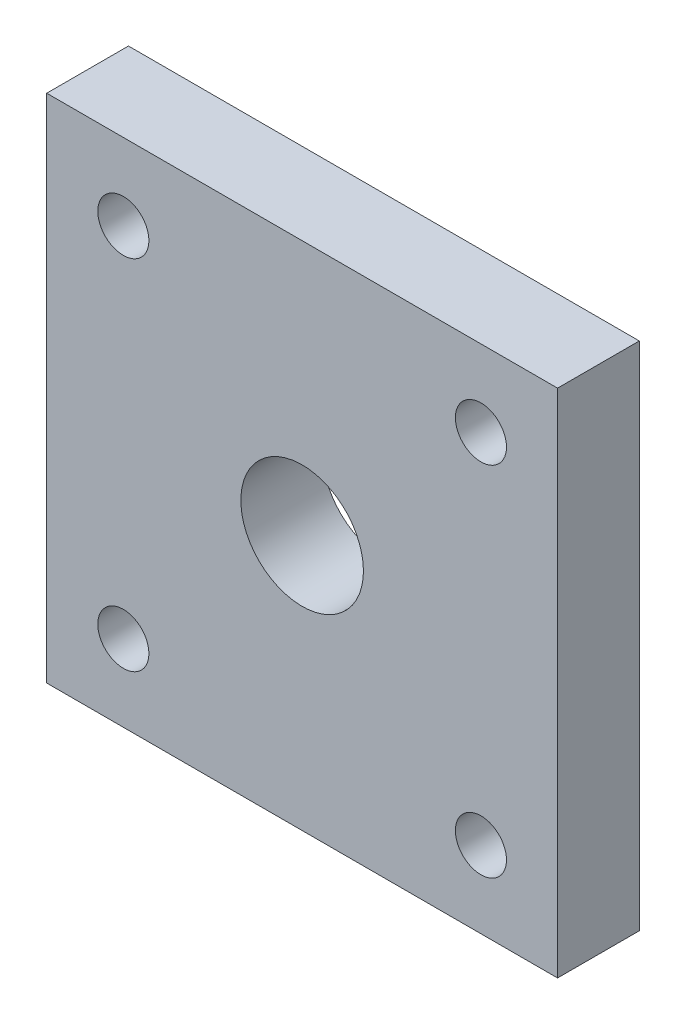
ISO-10303-21;
HEADER;
FILE_DESCRIPTION(('STEP AP214'),'2;1');
FILE_NAME('part.step','',(''),(''),'','','');
FILE_SCHEMA(('AUTOMOTIVE_DESIGN { 1 0 10303 214 1 1 1 1 }'));
ENDSEC;
DATA;
#1=APPLICATION_CONTEXT('core data for automotive mechanical design processes');
#2=APPLICATION_PROTOCOL_DEFINITION('international standard','automotive_design',2000,#1);
#3=PRODUCT_CONTEXT('',#1,'mechanical');
#4=PRODUCT('Part','Part','',(#3));
#5=PRODUCT_RELATED_PRODUCT_CATEGORY('part','',(#4));
#6=PRODUCT_DEFINITION_FORMATION('','',#4);
#7=PRODUCT_DEFINITION_CONTEXT('part definition',#1,'design');
#8=PRODUCT_DEFINITION('design','',#6,#7);
#9=PRODUCT_DEFINITION_SHAPE('','',#8);
#10=(LENGTH_UNIT() NAMED_UNIT(*) SI_UNIT(.MILLI.,.METRE.));
#11=(NAMED_UNIT(*) PLANE_ANGLE_UNIT() SI_UNIT($,.RADIAN.));
#12=(NAMED_UNIT(*) SI_UNIT($,.STERADIAN.) SOLID_ANGLE_UNIT());
#13=UNCERTAINTY_MEASURE_WITH_UNIT(LENGTH_MEASURE(1.E-05),#10,'distance_accuracy_value','');
#14=(GEOMETRIC_REPRESENTATION_CONTEXT(3) GLOBAL_UNCERTAINTY_ASSIGNED_CONTEXT((#13)) GLOBAL_UNIT_ASSIGNED_CONTEXT((#10,
#11,#12)) REPRESENTATION_CONTEXT('',''));
#15=CARTESIAN_POINT('',(0.,0.,0.));
#16=DIRECTION('',(0.,0.,1.));
#17=DIRECTION('',(1.,0.,0.));
#18=AXIS2_PLACEMENT_3D('',#15,#16,#17);
#19=CARTESIAN_POINT('',(0.,0.,8.));
#20=DIRECTION('',(0.,0.,-1.));
#21=DIRECTION('',(-1.,0.,0.));
#22=AXIS2_PLACEMENT_3D('',#19,#20,#21);
#23=PLANE('',#22);
#24=CARTESIAN_POINT('',(17.5,-17.5,8.));
#25=DIRECTION('',(0.,0.,1.));
#26=DIRECTION('',(1.,0.,0.));
#27=AXIS2_PLACEMENT_3D('',#24,#25,#26);
#28=CIRCLE('',#27,2.5);
#29=CARTESIAN_POINT('',(20.,-17.5,8.));
#30=VERTEX_POINT('',#29);
#31=EDGE_CURVE('E134',#30,#30,#28,.T.);
#32=ORIENTED_EDGE('',*,*,#31,.F.);
#33=EDGE_LOOP('',(#32));
#34=FACE_BOUND('',#33,.T.);
#35=CARTESIAN_POINT('',(-17.5,-17.5,8.));
#36=DIRECTION('',(0.,0.,1.));
#37=DIRECTION('',(1.,0.,0.));
#38=AXIS2_PLACEMENT_3D('',#35,#36,#37);
#39=CIRCLE('',#38,2.5);
#40=CARTESIAN_POINT('',(-15.,-17.5,8.));
#41=VERTEX_POINT('',#40);
#42=EDGE_CURVE('E128',#41,#41,#39,.T.);
#43=ORIENTED_EDGE('',*,*,#42,.F.);
#44=EDGE_LOOP('',(#43));
#45=FACE_BOUND('',#44,.T.);
#46=CARTESIAN_POINT('',(-17.5,17.5,8.));
#47=DIRECTION('',(0.,0.,1.));
#48=DIRECTION('',(1.,0.,0.));
#49=AXIS2_PLACEMENT_3D('',#46,#47,#48);
#50=CIRCLE('',#49,2.5);
#51=CARTESIAN_POINT('',(-15.,17.5,8.));
#52=VERTEX_POINT('',#51);
#53=EDGE_CURVE('E122',#52,#52,#50,.T.);
#54=ORIENTED_EDGE('',*,*,#53,.F.);
#55=EDGE_LOOP('',(#54));
#56=FACE_BOUND('',#55,.T.);
#57=CARTESIAN_POINT('',(0.,0.,8.));
#58=DIRECTION('',(0.,0.,1.));
#59=DIRECTION('',(1.,0.,0.));
#60=AXIS2_PLACEMENT_3D('',#57,#58,#59);
#61=CIRCLE('',#60,6.);
#62=CARTESIAN_POINT('',(6.,0.,8.));
#63=VERTEX_POINT('',#62);
#64=EDGE_CURVE('E114',#63,#63,#61,.T.);
#65=ORIENTED_EDGE('',*,*,#64,.F.);
#66=EDGE_LOOP('',(#65));
#67=FACE_BOUND('',#66,.T.);
#68=DIRECTION('',(0.,1.,0.));
#69=VECTOR('',#68,1.);
#70=CARTESIAN_POINT('',(25.,-25.,8.));
#71=LINE('',#70,#69);
#72=CARTESIAN_POINT('',(25.,-25.,8.));
#73=VERTEX_POINT('',#72);
#74=CARTESIAN_POINT('',(25.,25.,8.));
#75=VERTEX_POINT('',#74);
#76=EDGE_CURVE('E88',#73,#75,#71,.T.);
#77=ORIENTED_EDGE('',*,*,#76,.T.);
#78=DIRECTION('',(-1.,0.,0.));
#79=VECTOR('',#78,1.);
#80=CARTESIAN_POINT('',(-25.,25.,8.));
#81=LINE('',#80,#79);
#82=CARTESIAN_POINT('',(-25.,25.,8.));
#83=VERTEX_POINT('',#82);
#84=EDGE_CURVE('E83',#75,#83,#81,.T.);
#85=ORIENTED_EDGE('',*,*,#84,.T.);
#86=DIRECTION('',(0.,-1.,0.));
#87=VECTOR('',#86,1.);
#88=CARTESIAN_POINT('',(-25.,-25.,8.));
#89=LINE('',#88,#87);
#90=CARTESIAN_POINT('',(-25.,-25.,8.));
#91=VERTEX_POINT('',#90);
#92=EDGE_CURVE('E86',#83,#91,#89,.T.);
#93=ORIENTED_EDGE('',*,*,#92,.T.);
#94=DIRECTION('',(1.,0.,0.));
#95=VECTOR('',#94,1.);
#96=CARTESIAN_POINT('',(-25.,-25.,8.));
#97=LINE('',#96,#95);
#98=EDGE_CURVE('E53',#91,#73,#97,.T.);
#99=ORIENTED_EDGE('',*,*,#98,.T.);
#100=EDGE_LOOP('',(#77,#85,#93,#99));
#101=FACE_BOUND('',#100,.T.);
#102=CARTESIAN_POINT('',(17.5,17.5,8.));
#103=DIRECTION('',(0.,0.,1.));
#104=DIRECTION('',(1.,0.,0.));
#105=AXIS2_PLACEMENT_3D('',#102,#103,#104);
#106=CIRCLE('',#105,2.5);
#107=CARTESIAN_POINT('',(20.,17.5,8.));
#108=VERTEX_POINT('',#107);
#109=EDGE_CURVE('E140',#108,#108,#106,.T.);
#110=ORIENTED_EDGE('',*,*,#109,.F.);
#111=EDGE_LOOP('',(#110));
#112=FACE_BOUND('',#111,.T.);
#113=ADVANCED_FACE('F36',(#34,#45,#56,#67,#101,#112),#23,.F.);
#114=CARTESIAN_POINT('',(25.,-25.,8.));
#115=DIRECTION('',(-1.,0.,0.));
#116=DIRECTION('',(0.,0.,1.));
#117=AXIS2_PLACEMENT_3D('',#114,#115,#116);
#118=PLANE('',#117);
#119=DIRECTION('',(0.,1.,0.));
#120=VECTOR('',#119,1.);
#121=CARTESIAN_POINT('',(25.,-25.,0.));
#122=LINE('',#121,#120);
#123=CARTESIAN_POINT('',(25.,-25.,0.));
#124=VERTEX_POINT('',#123);
#125=CARTESIAN_POINT('',(25.,25.,0.));
#126=VERTEX_POINT('',#125);
#127=EDGE_CURVE('E100',#124,#126,#122,.T.);
#128=ORIENTED_EDGE('',*,*,#127,.T.);
#129=DIRECTION('',(0.,0.,-1.));
#130=VECTOR('',#129,1.);
#131=CARTESIAN_POINT('',(25.,25.,8.));
#132=LINE('',#131,#130);
#133=EDGE_CURVE('E11',#75,#126,#132,.T.);
#134=ORIENTED_EDGE('',*,*,#133,.F.);
#135=ORIENTED_EDGE('',*,*,#76,.F.);
#136=DIRECTION('',(0.,0.,-1.));
#137=VECTOR('',#136,1.);
#138=CARTESIAN_POINT('',(25.,-25.,8.));
#139=LINE('',#138,#137);
#140=EDGE_CURVE('E96',#73,#124,#139,.T.);
#141=ORIENTED_EDGE('',*,*,#140,.T.);
#142=EDGE_LOOP('',(#128,#134,#135,#141));
#143=FACE_BOUND('',#142,.T.);
#144=ADVANCED_FACE('F38',(#143),#118,.F.);
#145=CARTESIAN_POINT('',(-25.,25.,8.));
#146=DIRECTION('',(0.,-1.,0.));
#147=DIRECTION('',(0.,0.,-1.));
#148=AXIS2_PLACEMENT_3D('',#145,#146,#147);
#149=PLANE('',#148);
#150=DIRECTION('',(-1.,0.,0.));
#151=VECTOR('',#150,1.);
#152=CARTESIAN_POINT('',(-25.,25.,0.));
#153=LINE('',#152,#151);
#154=CARTESIAN_POINT('',(-25.,25.,0.));
#155=VERTEX_POINT('',#154);
#156=EDGE_CURVE('E92',#126,#155,#153,.T.);
#157=ORIENTED_EDGE('',*,*,#156,.T.);
#158=DIRECTION('',(0.,0.,-1.));
#159=VECTOR('',#158,1.);
#160=CARTESIAN_POINT('',(-25.,25.,8.));
#161=LINE('',#160,#159);
#162=EDGE_CURVE('E45',#83,#155,#161,.T.);
#163=ORIENTED_EDGE('',*,*,#162,.F.);
#164=ORIENTED_EDGE('',*,*,#84,.F.);
#165=ORIENTED_EDGE('',*,*,#133,.T.);
#166=EDGE_LOOP('',(#157,#163,#164,#165));
#167=FACE_BOUND('',#166,.T.);
#168=ADVANCED_FACE('F91',(#167),#149,.F.);
#169=CARTESIAN_POINT('',(-25.,-25.,8.));
#170=DIRECTION('',(1.,0.,0.));
#171=DIRECTION('',(0.,0.,-1.));
#172=AXIS2_PLACEMENT_3D('',#169,#170,#171);
#173=PLANE('',#172);
#174=DIRECTION('',(0.,-1.,0.));
#175=VECTOR('',#174,1.);
#176=CARTESIAN_POINT('',(-25.,-25.,0.));
#177=LINE('',#176,#175);
#178=CARTESIAN_POINT('',(-25.,-25.,0.));
#179=VERTEX_POINT('',#178);
#180=EDGE_CURVE('E70',#155,#179,#177,.T.);
#181=ORIENTED_EDGE('',*,*,#180,.T.);
#182=DIRECTION('',(0.,0.,-1.));
#183=VECTOR('',#182,1.);
#184=CARTESIAN_POINT('',(-25.,-25.,8.));
#185=LINE('',#184,#183);
#186=EDGE_CURVE('E93',#91,#179,#185,.T.);
#187=ORIENTED_EDGE('',*,*,#186,.F.);
#188=ORIENTED_EDGE('',*,*,#92,.F.);
#189=ORIENTED_EDGE('',*,*,#162,.T.);
#190=EDGE_LOOP('',(#181,#187,#188,#189));
#191=FACE_BOUND('',#190,.T.);
#192=ADVANCED_FACE('F94',(#191),#173,.F.);
#193=CARTESIAN_POINT('',(-25.,-25.,8.));
#194=DIRECTION('',(0.,1.,0.));
#195=DIRECTION('',(0.,0.,1.));
#196=AXIS2_PLACEMENT_3D('',#193,#194,#195);
#197=PLANE('',#196);
#198=DIRECTION('',(1.,0.,0.));
#199=VECTOR('',#198,1.);
#200=CARTESIAN_POINT('',(-25.,-25.,0.));
#201=LINE('',#200,#199);
#202=EDGE_CURVE('E76',#179,#124,#201,.T.);
#203=ORIENTED_EDGE('',*,*,#202,.T.);
#204=ORIENTED_EDGE('',*,*,#140,.F.);
#205=ORIENTED_EDGE('',*,*,#98,.F.);
#206=ORIENTED_EDGE('',*,*,#186,.T.);
#207=EDGE_LOOP('',(#203,#204,#205,#206));
#208=FACE_BOUND('',#207,.T.);
#209=ADVANCED_FACE('F108',(#208),#197,.F.);
#210=CARTESIAN_POINT('',(0.,0.,0.));
#211=DIRECTION('',(0.,0.,-1.));
#212=DIRECTION('',(-1.,0.,0.));
#213=AXIS2_PLACEMENT_3D('',#210,#211,#212);
#214=PLANE('',#213);
#215=CARTESIAN_POINT('',(17.5,17.5,0.));
#216=DIRECTION('',(0.,0.,-1.));
#217=DIRECTION('',(-1.,0.,0.));
#218=AXIS2_PLACEMENT_3D('',#215,#216,#217);
#219=CIRCLE('',#218,2.5);
#220=CARTESIAN_POINT('',(15.,17.5,0.));
#221=VERTEX_POINT('',#220);
#222=EDGE_CURVE('E137',#221,#221,#219,.T.);
#223=ORIENTED_EDGE('',*,*,#222,.F.);
#224=EDGE_LOOP('',(#223));
#225=FACE_BOUND('',#224,.T.);
#226=CARTESIAN_POINT('',(17.5,-17.5,0.));
#227=DIRECTION('',(0.,0.,-1.));
#228=DIRECTION('',(-1.,0.,0.));
#229=AXIS2_PLACEMENT_3D('',#226,#227,#228);
#230=CIRCLE('',#229,2.5);
#231=CARTESIAN_POINT('',(15.,-17.5,0.));
#232=VERTEX_POINT('',#231);
#233=EDGE_CURVE('E131',#232,#232,#230,.T.);
#234=ORIENTED_EDGE('',*,*,#233,.F.);
#235=EDGE_LOOP('',(#234));
#236=FACE_BOUND('',#235,.T.);
#237=CARTESIAN_POINT('',(-17.5,-17.5,0.));
#238=DIRECTION('',(0.,0.,-1.));
#239=DIRECTION('',(-1.,0.,0.));
#240=AXIS2_PLACEMENT_3D('',#237,#238,#239);
#241=CIRCLE('',#240,2.5);
#242=CARTESIAN_POINT('',(-20.,-17.5,0.));
#243=VERTEX_POINT('',#242);
#244=EDGE_CURVE('E125',#243,#243,#241,.T.);
#245=ORIENTED_EDGE('',*,*,#244,.F.);
#246=EDGE_LOOP('',(#245));
#247=FACE_BOUND('',#246,.T.);
#248=CARTESIAN_POINT('',(-17.5,17.5,0.));
#249=DIRECTION('',(0.,0.,-1.));
#250=DIRECTION('',(-1.,0.,0.));
#251=AXIS2_PLACEMENT_3D('',#248,#249,#250);
#252=CIRCLE('',#251,2.5);
#253=CARTESIAN_POINT('',(-20.,17.5,0.));
#254=VERTEX_POINT('',#253);
#255=EDGE_CURVE('E117',#254,#254,#252,.T.);
#256=ORIENTED_EDGE('',*,*,#255,.F.);
#257=EDGE_LOOP('',(#256));
#258=FACE_BOUND('',#257,.T.);
#259=CARTESIAN_POINT('',(0.,0.,0.));
#260=DIRECTION('',(0.,0.,1.));
#261=DIRECTION('',(1.,0.,0.));
#262=AXIS2_PLACEMENT_3D('',#259,#260,#261);
#263=CIRCLE('',#262,6.);
#264=CARTESIAN_POINT('',(6.,0.,0.));
#265=VERTEX_POINT('',#264);
#266=EDGE_CURVE('E103',#265,#265,#263,.T.);
#267=ORIENTED_EDGE('',*,*,#266,.T.);
#268=EDGE_LOOP('',(#267));
#269=FACE_BOUND('',#268,.T.);
#270=ORIENTED_EDGE('',*,*,#127,.F.);
#271=ORIENTED_EDGE('',*,*,#202,.F.);
#272=ORIENTED_EDGE('',*,*,#180,.F.);
#273=ORIENTED_EDGE('',*,*,#156,.F.);
#274=EDGE_LOOP('',(#270,#271,#272,#273));
#275=FACE_BOUND('',#274,.T.);
#276=ADVANCED_FACE('F111',(#225,#236,#247,#258,#269,#275),#214,.T.);
#277=CARTESIAN_POINT('',(0.,0.,0.));
#278=DIRECTION('',(0.,0.,1.));
#279=DIRECTION('',(1.,0.,0.));
#280=AXIS2_PLACEMENT_3D('',#277,#278,#279);
#281=CYLINDRICAL_SURFACE('',#280,6.);
#282=ORIENTED_EDGE('',*,*,#266,.F.);
#283=EDGE_LOOP('',(#282));
#284=FACE_BOUND('',#283,.T.);
#285=ORIENTED_EDGE('',*,*,#64,.T.);
#286=EDGE_LOOP('',(#285));
#287=FACE_BOUND('',#286,.T.);
#288=ADVANCED_FACE('F156',(#284,#287),#281,.F.);
#289=CARTESIAN_POINT('',(-17.5,17.5,8.));
#290=DIRECTION('',(0.,0.,1.));
#291=DIRECTION('',(1.,0.,0.));
#292=AXIS2_PLACEMENT_3D('',#289,#290,#291);
#293=CYLINDRICAL_SURFACE('',#292,2.5);
#294=ORIENTED_EDGE('',*,*,#53,.T.);
#295=EDGE_LOOP('',(#294));
#296=FACE_BOUND('',#295,.T.);
#297=ORIENTED_EDGE('',*,*,#255,.T.);
#298=EDGE_LOOP('',(#297));
#299=FACE_BOUND('',#298,.T.);
#300=ADVANCED_FACE('F188',(#296,#299),#293,.F.);
#301=CARTESIAN_POINT('',(-17.5,-17.5,8.));
#302=DIRECTION('',(0.,0.,1.));
#303=DIRECTION('',(1.,0.,0.));
#304=AXIS2_PLACEMENT_3D('',#301,#302,#303);
#305=CYLINDRICAL_SURFACE('',#304,2.5);
#306=ORIENTED_EDGE('',*,*,#42,.T.);
#307=EDGE_LOOP('',(#306));
#308=FACE_BOUND('',#307,.T.);
#309=ORIENTED_EDGE('',*,*,#244,.T.);
#310=EDGE_LOOP('',(#309));
#311=FACE_BOUND('',#310,.T.);
#312=ADVANCED_FACE('F195',(#308,#311),#305,.F.);
#313=CARTESIAN_POINT('',(17.5,-17.5,8.));
#314=DIRECTION('',(0.,0.,1.));
#315=DIRECTION('',(1.,0.,0.));
#316=AXIS2_PLACEMENT_3D('',#313,#314,#315);
#317=CYLINDRICAL_SURFACE('',#316,2.5);
#318=ORIENTED_EDGE('',*,*,#31,.T.);
#319=EDGE_LOOP('',(#318));
#320=FACE_BOUND('',#319,.T.);
#321=ORIENTED_EDGE('',*,*,#233,.T.);
#322=EDGE_LOOP('',(#321));
#323=FACE_BOUND('',#322,.T.);
#324=ADVANCED_FACE('F201',(#320,#323),#317,.F.);
#325=CARTESIAN_POINT('',(17.5,17.5,8.));
#326=DIRECTION('',(0.,0.,1.));
#327=DIRECTION('',(1.,0.,0.));
#328=AXIS2_PLACEMENT_3D('',#325,#326,#327);
#329=CYLINDRICAL_SURFACE('',#328,2.5);
#330=ORIENTED_EDGE('',*,*,#109,.T.);
#331=EDGE_LOOP('',(#330));
#332=FACE_BOUND('',#331,.T.);
#333=ORIENTED_EDGE('',*,*,#222,.T.);
#334=EDGE_LOOP('',(#333));
#335=FACE_BOUND('',#334,.T.);
#336=ADVANCED_FACE('F144',(#332,#335),#329,.F.);
#337=CLOSED_SHELL('',(#113,#144,#168,#192,#209,#276,#288,#300,#312,#324,#336));
#338=MANIFOLD_SOLID_BREP('B2',#337);
#339=ADVANCED_BREP_SHAPE_REPRESENTATION('',(#18,#338),#14);
#340=SHAPE_DEFINITION_REPRESENTATION(#9,#339);
ENDSEC;
END-ISO-10303-21;
